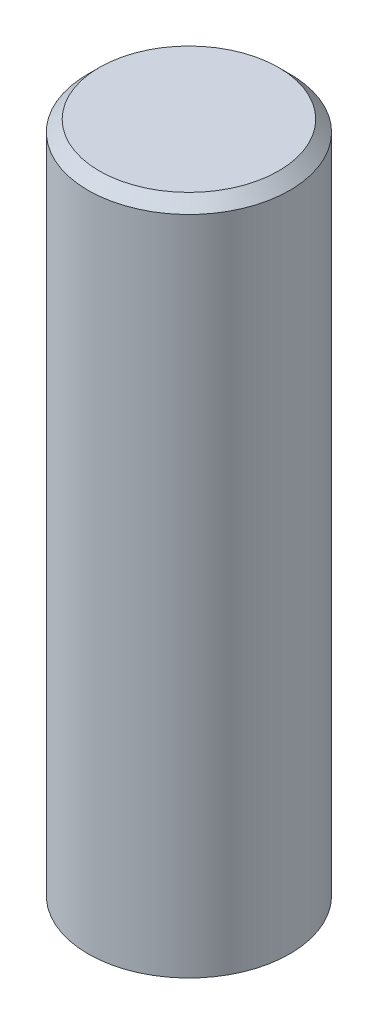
from build123d import *

# Parameters (mm, degrees)
SKETCH1_R           = 9
BOSS_EXTRUDE1_DEPTH = 60
CHAMFER1_SIZE       = 1


with BuildPart() as part:
    # Sketch1 → Boss-Extrude1 (new body)
    with BuildSketch(Plane(origin=(0, 0, 0), x_dir=(1, 0, 0), z_dir=(0, 1, 0))):
        with Locations(Location((0, 0, 0), (0, 0, 270))):
            Circle(SKETCH1_R)
    extrude(amount=BOSS_EXTRUDE1_DEPTH)

    # Chamfer1
    chamfer1_edges = [part.edges().sort_by_distance(p)[0] for p in [
        (0, 60, -9),
    ]]
    chamfer(chamfer1_edges, length=CHAMFER1_SIZE)


solid = part.part
